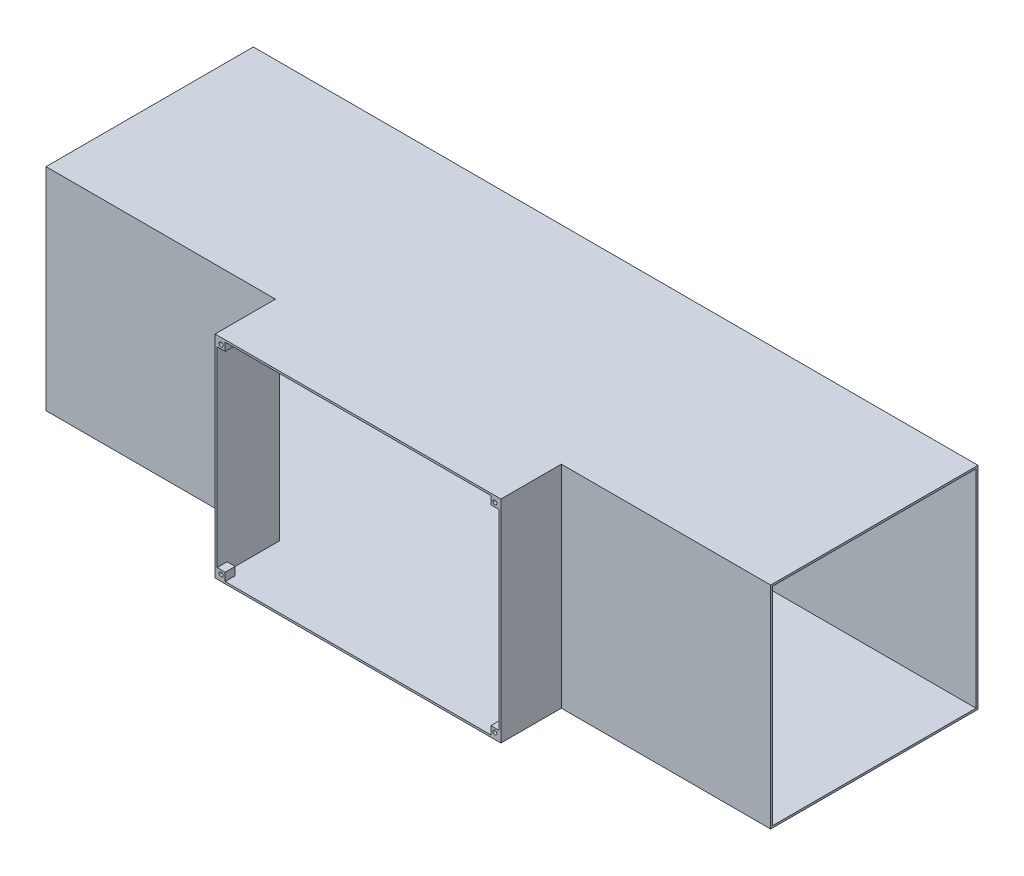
from build123d import *

# Parameters (mm, degrees)
SKETCH1_W           = 261.62
SKETCH1_H           = 266.7
SKETCH1_W_2         = 256.54
SKETCH1_H_2         = 261.62
BOSS_EXTRUDE1_DEPTH = 914.4
SKETCH2_W           = 355.6
SKETCH2_H           = 261.62
CUT_EXTRUDE1_DEPTH  = 25.4
SKETCH3_W           = 360.68
SKETCH3_H           = 266.7
SKETCH3_W_2         = 355.6
SKETCH3_H_2         = 261.62
BOSS_EXTRUDE2_DEPTH = 76.2
SKETCH6_W           = 10.16
SKETCH6_H           = 10.16
SKETCH6_R           = 2.54
BOSS_EXTRUDE5_DEPTH = 12.7


with BuildPart() as part:
    # Sketch1 → Boss-Extrude1 (new body)
    with BuildSketch(Plane(origin=(0, 0, 0), x_dir=(0, 0, -1), z_dir=(1, 0, 0))):
        with Locations((11.994444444, 40.201654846)):
            Rectangle(SKETCH1_W, SKETCH1_H)
        with Locations((11.994444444, 40.201654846)):
            Rectangle(SKETCH1_W_2, SKETCH1_H_2, mode=Mode.SUBTRACT)
    extrude(amount=BOSS_EXTRUDE1_DEPTH)

    # Sketch2 → Cut-Extrude1 (cut)
    with BuildSketch(Plane.XY.offset(118.815555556)):
        with Locations((469.9, 40.201654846)):
            Rectangle(SKETCH2_W, SKETCH2_H)
    extrude(amount=-CUT_EXTRUDE1_DEPTH, mode=Mode.SUBTRACT)

    # Sketch3 → Boss-Extrude2 (add)
    with BuildSketch(Plane.XY.offset(118.815555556)):
        with Locations((469.9, 40.201654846)):
            Rectangle(SKETCH3_W, SKETCH3_H)
        with Locations((469.9, 40.201654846)):
            Rectangle(SKETCH3_W_2, SKETCH3_H_2, mode=Mode.SUBTRACT)
    extrude(amount=BOSS_EXTRUDE2_DEPTH)

    # Sketch6 → Boss-Extrude5 (add)
    # profile 1 of 4: a face of its own
    with BuildSketch(Plane.XY.offset(195.015555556)):
        with Locations((297.18, 165.931654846)):
            Rectangle(SKETCH6_W, SKETCH6_H)
        with Locations((297.18, 165.931654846)):
            Circle(SKETCH6_R, mode=Mode.SUBTRACT)
    # profile 2 of 4: a face of its own
    with BuildSketch(Plane.XY.offset(195.015555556)):
        with Locations((297.18, -85.528345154)):
            Rectangle(SKETCH6_W, SKETCH6_H)
        with Locations((297.18, -85.528345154)):
            Circle(SKETCH6_R, mode=Mode.SUBTRACT)
    # profile 3 of 4: a face of its own
    with BuildSketch(Plane.XY.offset(195.015555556)):
        with Locations((642.62, 165.931654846)):
            Rectangle(SKETCH6_W, SKETCH6_H)
        with Locations((642.62, 165.931654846)):
            Circle(SKETCH6_R, mode=Mode.SUBTRACT)
    # profile 4 of 4: a face of its own
    with BuildSketch(Plane.XY.offset(195.015555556)):
        with Locations((642.62, -85.528345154)):
            Rectangle(SKETCH6_W, SKETCH6_H)
        with Locations((642.62, -85.528345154)):
            Circle(SKETCH6_R, mode=Mode.SUBTRACT)
    extrude(amount=-BOSS_EXTRUDE5_DEPTH)


solid = part.part
